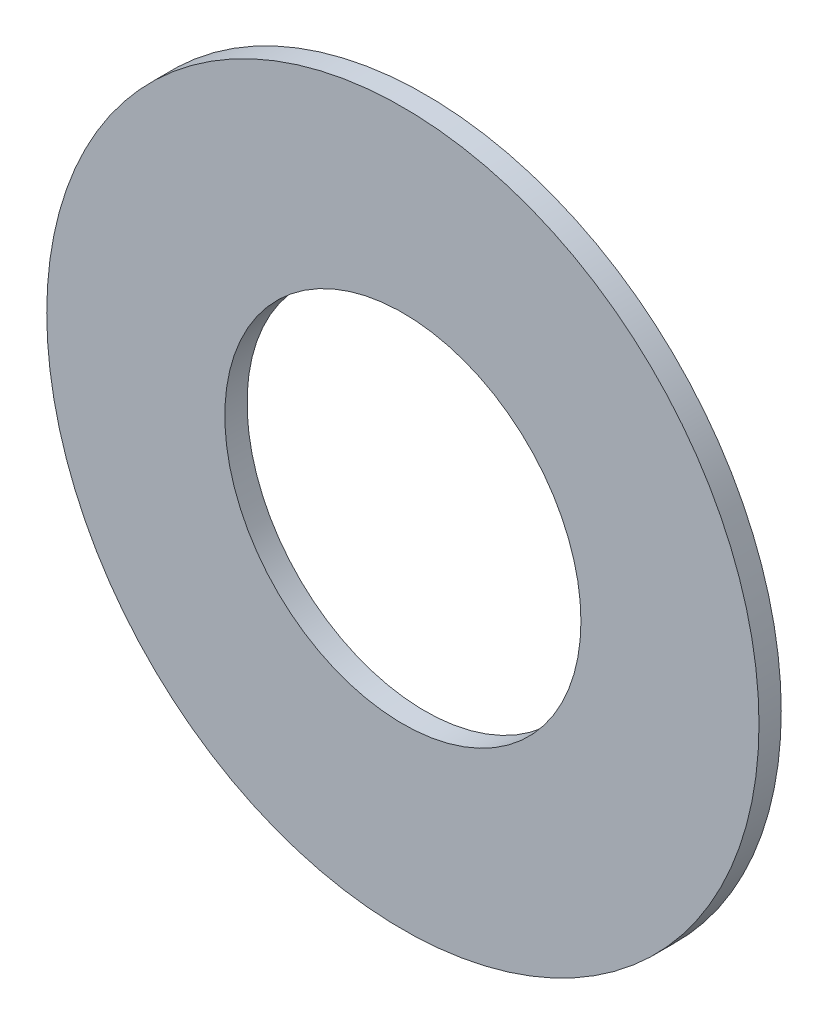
from build123d import *

# Parameters (mm, degrees)
ESQUISSE1_R          = 8
ESQUISSE1_R_2        = 4
BASE_EXTRUSION_DEPTH = 0.5


with BuildPart() as part:
    # Esquisse1 → Base-Extrusion (new body)
    with BuildSketch(Plane.XY):
        with Locations((0, 24.777112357)):
            Circle(ESQUISSE1_R)
        with Locations((0, 24.777112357)):
            Circle(ESQUISSE1_R_2, mode=Mode.SUBTRACT)
    extrude(amount=BASE_EXTRUSION_DEPTH)


solid = part.part
